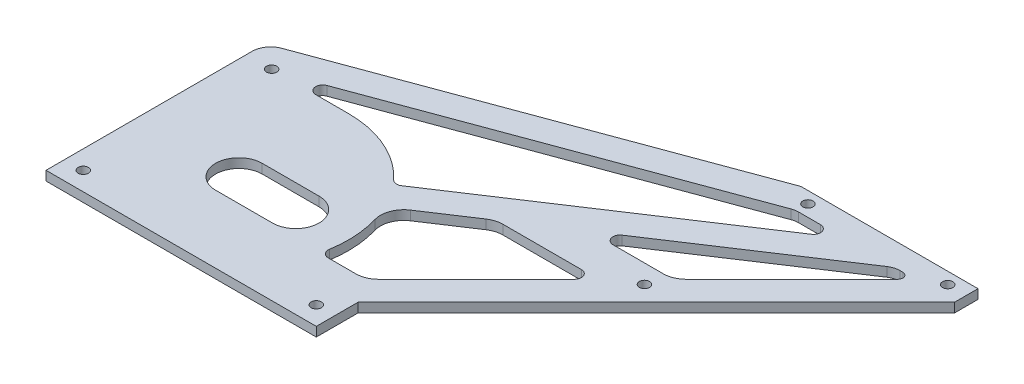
from build123d import *

# Parameters (mm, degrees)
ESQUISSE1_R        = 1.1
BOSS_EXTRU_1_DEPTH = 2


with BuildPart() as part:
    # Esquisse1 → Boss.-Extru.1 (new body)
    with BuildSketch(Plane(origin=(0, 0, 0), x_dir=(1, 0, 0), z_dir=(0, 1, 0))):
        with BuildLine():
            Line((-4, 40.212490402), (-4, -4))
            Line((-4, -4), (54, -4))
            Line((54, -4), (54, 5))
            Line((54, 5), (118, 69))
            Line((118, 69), (118, 74))
            Line((118, 74), (80, 74))
            Line((80, 74), (-1.38489148, 43.965099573))
            ThreePointArc((-1.38489148, 43.965099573), (-3.281734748, 42.499457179), (-4, 40.212490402))
        make_face()
        with Locations(Location((0, 0, 0), (0, 0, 270))):
            Circle(ESQUISSE1_R, mode=Mode.SUBTRACT)
        with Locations(Location((50, 0, 0), (0, 0, 90))):
            Circle(ESQUISSE1_R, mode=Mode.SUBTRACT)
        with Locations(Location((84, 71.5, 0), (0, 0, 270))):
            Circle(ESQUISSE1_R, mode=Mode.SUBTRACT)
        with Locations(Location((81.419277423, 39, 0), (0, 0, 270))):
            Circle(ESQUISSE1_R, mode=Mode.SUBTRACT)
        with Locations(Location((1.419277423, 39, 0), (0, 0, 90))):
            Circle(ESQUISSE1_R, mode=Mode.SUBTRACT)
        with Locations(Location((114, 71.5, 0), (0, 0, 270))):
            Circle(ESQUISSE1_R, mode=Mode.SUBTRACT)
        with BuildLine():
            Line((42.577925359, 10), (48.443650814, 10))
            ThreePointArc((48.443650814, 10), (50.357067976, 10.380602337), (51.97918472, 11.464466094))
            Line((51.97918472, 11.464466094), (72.954058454, 32.439339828))
            ThreePointArc((72.954058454, 32.439339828), (73.279217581, 34.074025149), (71.893398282, 35))
            Line((71.893398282, 35), (55.047180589, 35))
            ThreePointArc((55.047180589, 35), (53.609987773, 34.788995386), (52.294096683, 34.173790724))
            Line((52.294096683, 34.173790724), (42.491150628, 27.707646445))
            ThreePointArc((42.491150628, 27.707646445), (40.549027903, 25.252877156), (40.447000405, 22.124407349))
            ThreePointArc((40.447000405, 22.124407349), (41.354063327, 16.968643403), (41.097249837, 11.74))
            ThreePointArc((41.097249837, 11.74), (41.435559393, 10.527888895), (42.577925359, 10))
        make_face(mode=Mode.SUBTRACT)
        with BuildLine():
            Line((17.9, 39), (10.888153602, 39))
            ThreePointArc((10.888153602, 39), (9.411528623, 40.236222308), (10.368819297, 41.907228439))
            Line((10.368819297, 41.907228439), (83.11114128, 68.752609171))
            ThreePointArc((83.11114128, 68.752609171), (83.792625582, 68.937666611), (84.49603276, 69))
            Line((84.49603276, 69), (89.196939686, 69))
            ThreePointArc((89.196939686, 69), (90.633638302, 67.931157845), (90.022864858, 66.247862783))
            Line((90.022864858, 66.247862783), (37.020186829, 31.286641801))
            ThreePointArc((37.020186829, 31.286641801), (36.016321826, 31.049370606), (35.096605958, 31.516452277))
            ThreePointArc((35.096605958, 31.516452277), (27.277189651, 37.048046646), (17.9, 39))
        make_face(mode=Mode.SUBTRACT)
        with BuildLine():
            Line((104.090036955, 68.339032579), (69.84735581, 45.752137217))
            ThreePointArc((69.84735581, 45.752137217), (69.236582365, 44.068842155), (70.673280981, 43))
            Line((70.673280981, 43), (81.443650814, 43))
            ThreePointArc((81.443650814, 43), (83.357067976, 43.380602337), (84.97918472, 44.464466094))
            Line((84.97918472, 44.464466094), (107.636901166, 67.122182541))
            ThreePointArc((107.636901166, 67.122182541), (107.875351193, 68.320951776), (106.859083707, 69))
            Line((106.859083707, 69), (106.29250408, 69))
            ThreePointArc((106.29250408, 69), (105.142749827, 68.831196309), (104.090036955, 68.339032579))
        make_face(mode=Mode.SUBTRACT)
        with BuildLine():
            Line((17.9, 20.5), (30.1, 20.5))
            ThreePointArc((30.1, 20.5), (35.1, 15.5), (30.1, 10.5))
            Line((30.1, 10.5), (17.9, 10.5))
            ThreePointArc((17.9, 10.5), (12.9, 15.5), (17.9, 20.5))
        make_face(mode=Mode.SUBTRACT)
    extrude(amount=BOSS_EXTRU_1_DEPTH)


solid = part.part
